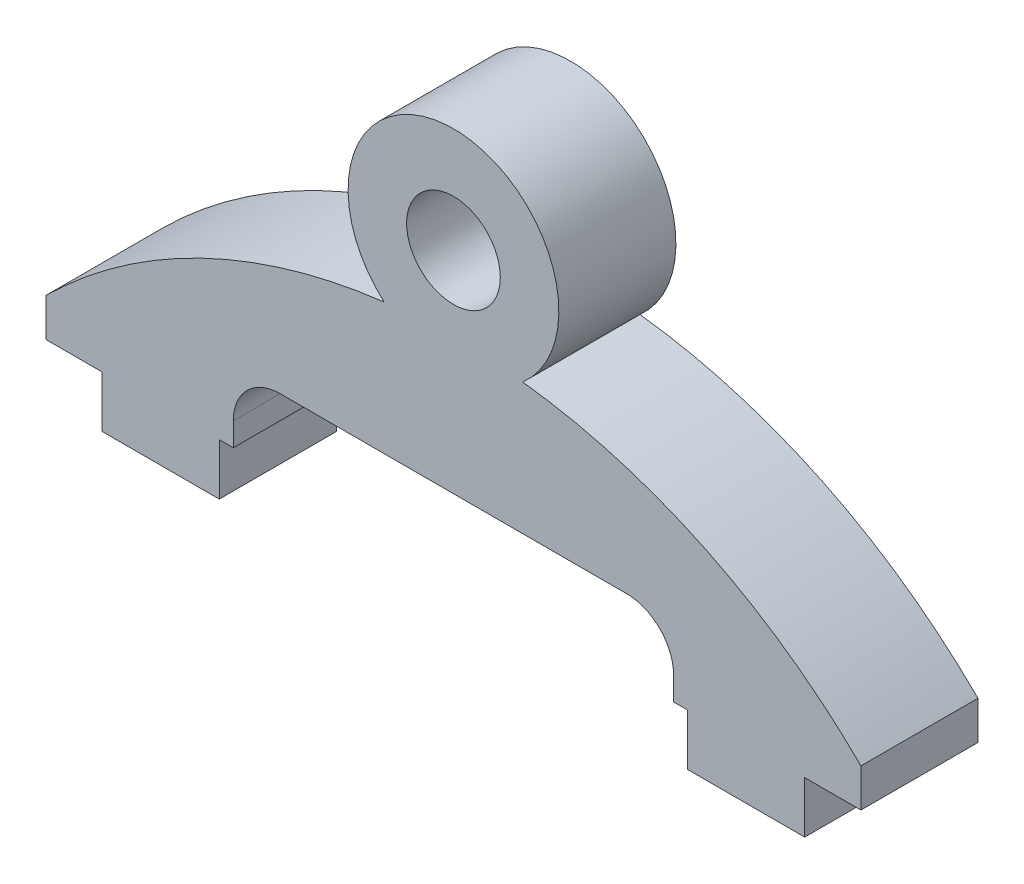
from build123d import *

# Parameters (mm, degrees)
SKETCH1_R           = 5.715
SKETCH1_R_2         = 2.54
SKETCH1_W           = 6.35
SKETCH1_H           = 2.794
BOSS_EXTRUDE1_DEPTH = 6.35


with BuildPart() as part:
    # Sketch1 → Boss-Extrude1 (new body)
    # profile 1 of 4: a face of its own
    with BuildSketch(Plane.XY):
        with BuildLine():
            Line((-22.098, 2.076633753), (-22.098, 0))
            Line((-22.098, 0), (-19.05, 0))
            Line((-19.05, 0), (-12.7, 0))
            Line((-12.7, 0), (-11.938, 0))
            Line((-11.938, 0), (-11.938, 1.27))
            ThreePointArc((-11.938, 1.27), (-11.194051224, 3.066051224), (-9.398, 3.81))
            Line((-9.398, 3.81), (9.398, 3.81))
            ThreePointArc((9.398, 3.81), (11.194051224, 3.066051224), (11.938, 1.27))
            Line((11.938, 1.27), (11.938, 0))
            Line((11.938, 0), (12.7, 0))
            Line((12.7, 0), (19.05, 0))
            Line((19.05, 0), (22.098, 0))
            Line((22.098, 0), (22.098, 2.076633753))
            ThreePointArc((22.098, 2.076633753), (13.669268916, 8.040224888), (3.758085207, 10.934419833))
            ThreePointArc((3.758085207, 10.934419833), (0, 9.525), (-3.758085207, 10.934419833))
            ThreePointArc((-3.758085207, 10.934419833), (-13.669268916, 8.040224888), (-22.098, 2.076633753))
        make_face()
    # profile 2 of 4: a face of its own
    with BuildSketch(Plane.XY):
        with Locations((0, 15.24)):
            Circle(SKETCH1_R)
        with Locations((0, 15.24)):
            Circle(SKETCH1_R_2, mode=Mode.SUBTRACT)
    # profile 3 of 4: a face of its own
    with BuildSketch(Plane.XY):
        with Locations((15.875, -1.397)):
            Rectangle(SKETCH1_W, SKETCH1_H)
    # profile 4 of 4: a face of its own
    with BuildSketch(Plane.XY):
        with Locations((-15.875, -1.397)):
            Rectangle(SKETCH1_W, SKETCH1_H)
    extrude(amount=BOSS_EXTRUDE1_DEPTH)


solid = part.part
